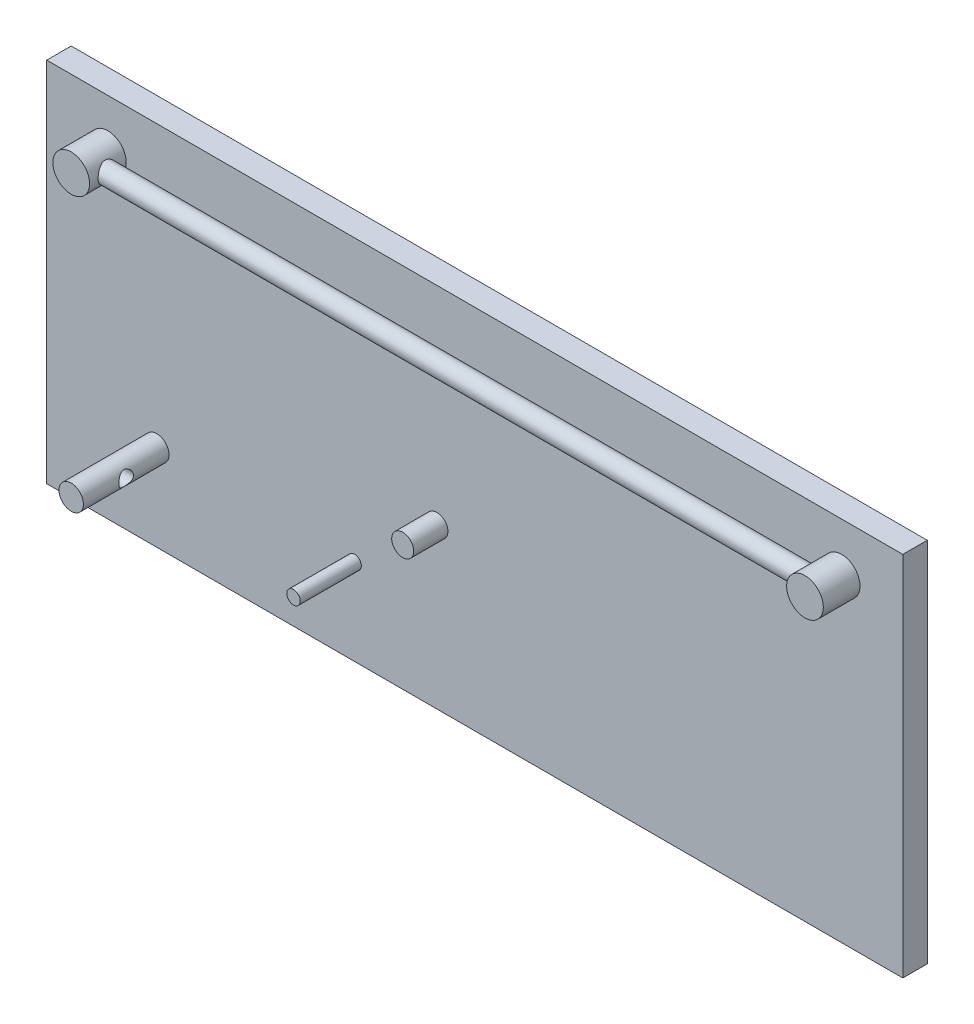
ISO-10303-21;
HEADER;
FILE_DESCRIPTION(('STEP AP214'),'2;1');
FILE_NAME('part.step','',(''),(''),'','','');
FILE_SCHEMA(('AUTOMOTIVE_DESIGN { 1 0 10303 214 1 1 1 1 }'));
ENDSEC;
DATA;
#1=APPLICATION_CONTEXT('core data for automotive mechanical design processes');
#2=APPLICATION_PROTOCOL_DEFINITION('international standard','automotive_design',2000,#1);
#3=PRODUCT_CONTEXT('',#1,'mechanical');
#4=PRODUCT('Part','Part','',(#3));
#5=PRODUCT_RELATED_PRODUCT_CATEGORY('part','',(#4));
#6=PRODUCT_DEFINITION_FORMATION('','',#4);
#7=PRODUCT_DEFINITION_CONTEXT('part definition',#1,'design');
#8=PRODUCT_DEFINITION('design','',#6,#7);
#9=PRODUCT_DEFINITION_SHAPE('','',#8);
#10=(LENGTH_UNIT() NAMED_UNIT(*) SI_UNIT(.MILLI.,.METRE.));
#11=(NAMED_UNIT(*) PLANE_ANGLE_UNIT() SI_UNIT($,.RADIAN.));
#12=(NAMED_UNIT(*) SI_UNIT($,.STERADIAN.) SOLID_ANGLE_UNIT());
#13=UNCERTAINTY_MEASURE_WITH_UNIT(LENGTH_MEASURE(1.E-05),#10,'distance_accuracy_value','');
#14=(GEOMETRIC_REPRESENTATION_CONTEXT(3) GLOBAL_UNCERTAINTY_ASSIGNED_CONTEXT((#13)) GLOBAL_UNIT_ASSIGNED_CONTEXT((#10,
#11,#12)) REPRESENTATION_CONTEXT('',''));
#15=CARTESIAN_POINT('',(0.,0.,0.));
#16=DIRECTION('',(0.,0.,1.));
#17=DIRECTION('',(1.,0.,0.));
#18=AXIS2_PLACEMENT_3D('',#15,#16,#17);
#19=CARTESIAN_POINT('',(-175.,-75.,10.));
#20=DIRECTION('',(0.,0.,1.));
#21=DIRECTION('',(1.,0.,0.));
#22=AXIS2_PLACEMENT_3D('',#19,#20,#21);
#23=PLANE('',#22);
#24=CARTESIAN_POINT('',(-130.,-39.7623712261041,10.));
#25=DIRECTION('',(0.,0.,1.));
#26=DIRECTION('',(1.,0.,0.));
#27=AXIS2_PLACEMENT_3D('',#24,#25,#26);
#28=CIRCLE('',#27,4.99999999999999);
#29=CARTESIAN_POINT('',(-125.,-39.7623712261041,10.));
#30=VERTEX_POINT('',#29);
#31=EDGE_CURVE('E192',#30,#30,#28,.T.);
#32=ORIENTED_EDGE('',*,*,#31,.F.);
#33=EDGE_LOOP('',(#32));
#34=FACE_BOUND('',#33,.T.);
#35=CARTESIAN_POINT('',(-150.,55.,10.));
#36=DIRECTION('',(0.,0.,1.));
#37=DIRECTION('',(-1.,0.,0.));
#38=AXIS2_PLACEMENT_3D('',#35,#36,#37);
#39=CIRCLE('',#38,7.50000000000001);
#40=CARTESIAN_POINT('',(-157.5,55.,10.));
#41=VERTEX_POINT('',#40);
#42=EDGE_CURVE('E175',#41,#41,#39,.T.);
#43=ORIENTED_EDGE('',*,*,#42,.F.);
#44=EDGE_LOOP('',(#43));
#45=FACE_BOUND('',#44,.T.);
#46=DIRECTION('',(0.,-1.,0.));
#47=VECTOR('',#46,1.);
#48=CARTESIAN_POINT('',(-175.,75.,10.));
#49=LINE('',#48,#47);
#50=CARTESIAN_POINT('',(-175.,75.,10.));
#51=VERTEX_POINT('',#50);
#52=CARTESIAN_POINT('',(-175.,-75.,10.));
#53=VERTEX_POINT('',#52);
#54=EDGE_CURVE('E109',#51,#53,#49,.T.);
#55=ORIENTED_EDGE('',*,*,#54,.T.);
#56=DIRECTION('',(1.,0.,0.));
#57=VECTOR('',#56,1.);
#58=CARTESIAN_POINT('',(-175.,-75.,10.));
#59=LINE('',#58,#57);
#60=CARTESIAN_POINT('',(175.,-75.,10.));
#61=VERTEX_POINT('',#60);
#62=EDGE_CURVE('E92',#53,#61,#59,.T.);
#63=ORIENTED_EDGE('',*,*,#62,.T.);
#64=DIRECTION('',(0.,1.,0.));
#65=VECTOR('',#64,1.);
#66=CARTESIAN_POINT('',(175.,75.,10.));
#67=LINE('',#66,#65);
#68=CARTESIAN_POINT('',(175.,75.,10.));
#69=VERTEX_POINT('',#68);
#70=EDGE_CURVE('E57',#61,#69,#67,.T.);
#71=ORIENTED_EDGE('',*,*,#70,.T.);
#72=DIRECTION('',(-1.,0.,0.));
#73=VECTOR('',#72,1.);
#74=CARTESIAN_POINT('',(-175.,75.,10.));
#75=LINE('',#74,#73);
#76=EDGE_CURVE('E52',#69,#51,#75,.T.);
#77=ORIENTED_EDGE('',*,*,#76,.T.);
#78=EDGE_LOOP('',(#55,#63,#71,#77));
#79=FACE_BOUND('',#78,.T.);
#80=CARTESIAN_POINT('',(150.,55.,10.));
#81=DIRECTION('',(0.,0.,1.));
#82=DIRECTION('',(1.,0.,0.));
#83=AXIS2_PLACEMENT_3D('',#80,#81,#82);
#84=CIRCLE('',#83,7.50000000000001);
#85=CARTESIAN_POINT('',(157.5,55.,10.));
#86=VERTEX_POINT('',#85);
#87=EDGE_CURVE('E102',#86,#86,#84,.T.);
#88=ORIENTED_EDGE('',*,*,#87,.F.);
#89=EDGE_LOOP('',(#88));
#90=FACE_BOUND('',#89,.T.);
#91=CARTESIAN_POINT('',(-15.4740295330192,-9.87837253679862,10.));
#92=DIRECTION('',(0.,0.,1.));
#93=DIRECTION('',(1.,0.,0.));
#94=AXIS2_PLACEMENT_3D('',#91,#92,#93);
#95=CIRCLE('',#94,4.5);
#96=CARTESIAN_POINT('',(-10.9740295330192,-9.87837253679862,10.));
#97=VERTEX_POINT('',#96);
#98=EDGE_CURVE('E186',#97,#97,#95,.T.);
#99=ORIENTED_EDGE('',*,*,#98,.F.);
#100=EDGE_LOOP('',(#99));
#101=FACE_BOUND('',#100,.T.);
#102=CARTESIAN_POINT('',(-49.1184439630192,-39.762371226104,10.));
#103=DIRECTION('',(0.,0.,1.));
#104=DIRECTION('',(1.,0.,0.));
#105=AXIS2_PLACEMENT_3D('',#102,#103,#104);
#106=CIRCLE('',#105,2.75);
#107=CARTESIAN_POINT('',(-46.3684439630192,-39.762371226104,10.));
#108=VERTEX_POINT('',#107);
#109=EDGE_CURVE('E226',#108,#108,#106,.T.);
#110=ORIENTED_EDGE('',*,*,#109,.F.);
#111=EDGE_LOOP('',(#110));
#112=FACE_BOUND('',#111,.T.);
#113=ADVANCED_FACE('F33',(#34,#45,#79,#90,#101,#112),#23,.T.);
#114=CARTESIAN_POINT('',(150.,55.,25.));
#115=DIRECTION('',(0.,0.,-1.));
#116=DIRECTION('',(-1.,0.,0.));
#117=AXIS2_PLACEMENT_3D('',#114,#115,#116);
#118=CYLINDRICAL_SURFACE('',#117,7.50000000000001);
#119=ORIENTED_EDGE('',*,*,#87,.T.);
#120=EDGE_LOOP('',(#119));
#121=FACE_BOUND('',#120,.T.);
#122=CARTESIAN_POINT('',(150.,55.,25.));
#123=DIRECTION('',(0.,0.,1.));
#124=DIRECTION('',(1.,0.,0.));
#125=AXIS2_PLACEMENT_3D('',#122,#123,#124);
#126=CIRCLE('',#125,7.50000000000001);
#127=CARTESIAN_POINT('',(157.5,55.,25.));
#128=VERTEX_POINT('',#127);
#129=EDGE_CURVE('E99',#128,#128,#126,.T.);
#130=ORIENTED_EDGE('',*,*,#129,.F.);
#131=EDGE_LOOP('',(#130));
#132=FACE_BOUND('',#131,.T.);
#133=CARTESIAN_POINT('',(142.5,55.,21.5));
#134=CARTESIAN_POINT('',(142.499999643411,55.1043292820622,21.5000004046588));
#135=CARTESIAN_POINT('',(142.502181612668,55.2086529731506,21.4959139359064));
#136=CARTESIAN_POINT('',(142.510852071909,55.4165195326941,21.4796211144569));
#137=CARTESIAN_POINT('',(142.517342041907,55.520062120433,21.4674119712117));
#138=CARTESIAN_POINT('',(142.534475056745,55.7256617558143,21.4350036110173));
#139=CARTESIAN_POINT('',(142.545122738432,55.827717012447,21.4147954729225));
#140=CARTESIAN_POINT('',(142.570297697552,56.0295097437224,21.3666381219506));
#141=CARTESIAN_POINT('',(142.584826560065,56.1292462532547,21.3386857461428));
#142=CARTESIAN_POINT('',(142.6335888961,56.4230748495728,21.2439272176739));
#143=CARTESIAN_POINT('',(142.673092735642,56.612856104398,21.1660473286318));
#144=CARTESIAN_POINT('',(142.762614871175,56.9762088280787,20.9836808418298));
#145=CARTESIAN_POINT('',(142.81263321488,57.149780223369,20.8791941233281));
#146=CARTESIAN_POINT('',(142.92260475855,57.4888283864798,20.6387413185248));
#147=CARTESIAN_POINT('',(142.98299608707,57.6530119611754,20.5011511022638));
#148=CARTESIAN_POINT('',(143.105646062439,57.957168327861,20.2019951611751));
#149=CARTESIAN_POINT('',(143.167906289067,58.0971199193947,20.0404086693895));
#150=CARTESIAN_POINT('',(143.29390118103,58.3617890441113,19.6800631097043));
#151=CARTESIAN_POINT('',(143.35725239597,58.4839528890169,19.4792578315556));
#152=CARTESIAN_POINT('',(143.442334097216,58.6401304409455,19.1623374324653));
#153=CARTESIAN_POINT('',(143.469044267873,58.6876894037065,19.0540404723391));
#154=CARTESIAN_POINT('',(143.518117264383,58.7732780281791,18.8328202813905));
#155=CARTESIAN_POINT('',(143.540482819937,58.8113136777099,18.719900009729));
#156=CARTESIAN_POINT('',(143.578670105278,58.875284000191,18.4973663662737));
#157=CARTESIAN_POINT('',(143.59481125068,58.9018220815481,18.3879811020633));
#158=CARTESIAN_POINT('',(143.621712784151,58.9456451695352,18.1667721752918));
#159=CARTESIAN_POINT('',(143.63247622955,58.9629354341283,18.0549499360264));
#160=CARTESIAN_POINT('',(143.648129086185,58.9879763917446,17.8299235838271));
#161=CARTESIAN_POINT('',(143.653023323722,58.9957349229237,17.7167206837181));
#162=CARTESIAN_POINT('',(143.656715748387,59.0015944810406,17.4899733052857));
#163=CARTESIAN_POINT('',(143.655514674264,58.9996966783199,17.376428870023));
#164=CARTESIAN_POINT('',(143.647674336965,58.9872297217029,17.1661195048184));
#165=CARTESIAN_POINT('',(143.641826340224,58.9779219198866,17.0692476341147));
#166=CARTESIAN_POINT('',(143.625896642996,58.9523442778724,16.8767703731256));
#167=CARTESIAN_POINT('',(143.615813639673,58.9360722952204,16.7811653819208));
#168=CARTESIAN_POINT('',(143.579685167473,58.8770796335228,16.4972327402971));
#169=CARTESIAN_POINT('',(143.547754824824,58.8241743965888,16.3116603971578));
#170=CARTESIAN_POINT('',(143.471185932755,58.6919483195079,15.9482808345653));
#171=CARTESIAN_POINT('',(143.42627800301,58.6120607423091,15.7707417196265));
#172=CARTESIAN_POINT('',(143.328747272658,58.4285815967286,15.4306591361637));
#173=CARTESIAN_POINT('',(143.276121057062,58.3249795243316,15.2681223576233));
#174=CARTESIAN_POINT('',(143.159775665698,58.0793506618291,14.9375729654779));
#175=CARTESIAN_POINT('',(143.095562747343,57.9339146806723,14.7722649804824));
#176=CARTESIAN_POINT('',(142.969414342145,57.6172236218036,14.4671045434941));
#177=CARTESIAN_POINT('',(142.907480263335,57.445952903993,14.3272676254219));
#178=CARTESIAN_POINT('',(142.819089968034,57.1667674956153,14.1356406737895));
#179=CARTESIAN_POINT('',(142.789630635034,57.0668672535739,14.0733399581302));
#180=CARTESIAN_POINT('',(142.733854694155,56.8613031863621,13.9574795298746));
#181=CARTESIAN_POINT('',(142.707536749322,56.7556418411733,13.9039160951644));
#182=CARTESIAN_POINT('',(142.65882020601,56.539277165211,13.8061244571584));
#183=CARTESIAN_POINT('',(142.636419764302,56.4285762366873,13.7618918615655));
#184=CARTESIAN_POINT('',(142.596209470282,56.2029177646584,13.6832925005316));
#185=CARTESIAN_POINT('',(142.578399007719,56.0879607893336,13.6489244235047));
#186=CARTESIAN_POINT('',(142.54931026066,55.8652619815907,13.5931739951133));
#187=CARTESIAN_POINT('',(142.537588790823,55.7578001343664,13.5709022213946));
#188=CARTESIAN_POINT('',(142.518748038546,55.5410189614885,13.5352350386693));
#189=CARTESIAN_POINT('',(142.511628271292,55.4316998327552,13.5218386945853));
#190=CARTESIAN_POINT('',(142.502197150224,55.2121724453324,13.5041141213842));
#191=CARTESIAN_POINT('',(142.499883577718,55.1019646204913,13.499781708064));
#192=CARTESIAN_POINT('',(142.50012545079,54.8815777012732,13.500235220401));
#193=CARTESIAN_POINT('',(142.502680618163,54.7713986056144,13.5050206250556));
#194=CARTESIAN_POINT('',(142.512134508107,54.5620171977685,13.522792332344));
#195=CARTESIAN_POINT('',(142.518616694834,54.4627286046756,13.5349925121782));
#196=CARTESIAN_POINT('',(142.535381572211,54.2656455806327,13.5667185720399));
#197=CARTESIAN_POINT('',(142.545665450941,54.1678516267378,13.5862467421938));
#198=CARTESIAN_POINT('',(142.58188649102,53.8777614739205,13.6555220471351));
#199=CARTESIAN_POINT('',(142.613202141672,53.6885697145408,13.715976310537));
#200=CARTESIAN_POINT('',(142.688372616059,53.3187187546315,13.8648791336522));
#201=CARTESIAN_POINT('',(142.732520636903,53.138389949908,13.9539881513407));
#202=CARTESIAN_POINT('',(142.829327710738,52.7946975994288,14.1568737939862));
#203=CARTESIAN_POINT('',(142.881990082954,52.6313407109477,14.2706600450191));
#204=CARTESIAN_POINT('',(142.997618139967,52.3075483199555,14.5337278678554));
#205=CARTESIAN_POINT('',(143.061082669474,52.149321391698,14.6855121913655));
#206=CARTESIAN_POINT('',(143.187363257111,51.8594549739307,15.0130503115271));
#207=CARTESIAN_POINT('',(143.250178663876,51.7278401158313,15.1888260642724));
#208=CARTESIAN_POINT('',(143.37252945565,51.4862815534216,15.5741875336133));
#209=CARTESIAN_POINT('',(143.431559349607,51.3783932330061,15.7852527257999));
#210=CARTESIAN_POINT('',(143.507378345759,51.2452071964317,16.1159144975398));
#211=CARTESIAN_POINT('',(143.530529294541,51.2055878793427,16.2284714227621));
#212=CARTESIAN_POINT('',(143.571628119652,51.136366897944,16.4575831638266));
#213=CARTESIAN_POINT('',(143.589576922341,51.106763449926,16.5741372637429));
#214=CARTESIAN_POINT('',(143.617933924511,51.0604701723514,16.7986232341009));
#215=CARTESIAN_POINT('',(143.628908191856,51.0428000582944,16.906282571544));
#216=CARTESIAN_POINT('',(143.645443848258,51.0163004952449,17.1230908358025));
#217=CARTESIAN_POINT('',(143.651005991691,51.0074698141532,17.2322395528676));
#218=CARTESIAN_POINT('',(143.656462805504,50.9988044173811,17.4509823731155));
#219=CARTESIAN_POINT('',(143.656360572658,50.9989647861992,17.5605762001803));
#220=CARTESIAN_POINT('',(143.650513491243,51.0082538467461,17.7791972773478));
#221=CARTESIAN_POINT('',(143.644769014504,51.0173819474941,17.8882245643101));
#222=CARTESIAN_POINT('',(143.62146710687,51.0547258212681,18.1865949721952));
#223=CARTESIAN_POINT('',(143.598265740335,51.0921489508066,18.3744376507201));
#224=CARTESIAN_POINT('',(143.53807089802,51.1925309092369,18.7407066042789));
#225=CARTESIAN_POINT('',(143.501072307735,51.2554992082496,18.9191293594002));
#226=CARTESIAN_POINT('',(143.414615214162,51.4095982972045,19.274512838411));
#227=CARTESIAN_POINT('',(143.36450757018,51.5022820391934,19.450638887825));
#228=CARTESIAN_POINT('',(143.258301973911,51.7116457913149,19.7860136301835));
#229=CARTESIAN_POINT('',(143.202200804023,51.8283387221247,19.9452531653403));
#230=CARTESIAN_POINT('',(143.080638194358,52.1020731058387,20.2663600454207));
#231=CARTESIAN_POINT('',(143.01499663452,52.2625093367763,20.4252756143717));
#232=CARTESIAN_POINT('',(142.88885125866,52.6092847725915,20.7148794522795));
#233=CARTESIAN_POINT('',(142.82835078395,52.7956406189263,20.8455494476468));
#234=CARTESIAN_POINT('',(142.74549083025,53.093912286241,21.018596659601));
#235=CARTESIAN_POINT('',(142.71891000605,53.1978594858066,21.0729731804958));
#236=CARTESIAN_POINT('',(142.669481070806,53.4108450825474,21.1726541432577));
#237=CARTESIAN_POINT('',(142.646631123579,53.5198809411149,21.2179630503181));
#238=CARTESIAN_POINT('',(142.605386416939,53.7420516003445,21.298883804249));
#239=CARTESIAN_POINT('',(142.586982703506,53.8551776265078,21.3345151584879));
#240=CARTESIAN_POINT('',(142.55515354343,54.0847532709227,21.3956928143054));
#241=CARTESIAN_POINT('',(142.541725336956,54.2012010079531,21.4212447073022));
#242=CARTESIAN_POINT('',(142.520773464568,54.4309218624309,21.4609467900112));
#243=CARTESIAN_POINT('',(142.513004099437,54.5440905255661,21.4755722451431));
#244=CARTESIAN_POINT('',(142.502617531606,54.7715083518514,21.4950986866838));
#245=CARTESIAN_POINT('',(142.500000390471,54.8857575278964,21.4999995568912));
#246=CARTESIAN_POINT('',(142.5,55.,21.5));
#247=B_SPLINE_CURVE_WITH_KNOTS('',3,(#133,#134,#135,#136,#137,#138,#139,#140,#141,#142,#143,
#144,#145,#146,#147,#148,#149,#150,#151,#152,#153,#154,#155,#156,#157,#158,#159,#160,#161,#162,
#163,#164,#165,#166,#167,#168,#169,#170,#171,#172,#173,#174,#175,#176,#177,#178,#179,#180,#181,
#182,#183,#184,#185,#186,#187,#188,#189,#190,#191,#192,#193,#194,#195,#196,#197,#198,#199,#200,
#201,#202,#203,#204,#205,#206,#207,#208,#209,#210,#211,#212,#213,#214,#215,#216,#217,#218,#219,
#220,#221,#222,#223,#224,#225,#226,#227,#228,#229,#230,#231,#232,#233,#234,#235,#236,#237,#238,
#239,#240,#241,#242,#243,#244,#245,#246),.UNSPECIFIED.,.T.,.F.,(4,2,2,2,2,2,2,2,2,2,2,2,2,2,2,2,
2,2,2,2,2,2,2,2,2,2,2,2,2,2,2,2,2,2,2,2,2,2,2,2,2,2,2,2,2,2,2,2,2,2,2,2,2,2,2,2,4),(0.,
0.312875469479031,0.625858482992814,0.939191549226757,1.25265277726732,1.87635275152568,
2.50005555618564,3.16498046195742,3.83048419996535,4.55668682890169,4.92002643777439,
5.28313701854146,5.6237663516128,5.96420180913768,6.30435713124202,6.64447122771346,
6.93659372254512,7.22880615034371,7.81285364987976,8.41002203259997,9.0074554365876,
9.69267368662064,10.3783084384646,10.7419894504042,11.1055151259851,11.4688692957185,
11.832175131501,12.1628321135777,12.4934542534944,12.8239237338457,13.1543743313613,
13.4547461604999,13.7552119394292,14.3555858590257,14.9709302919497,15.5865151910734,
16.2683843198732,16.9508817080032,17.6793249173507,18.0434998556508,18.407609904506,
18.736085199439,19.0645147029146,19.3927646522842,19.720992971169,20.2969971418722,
20.8732150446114,21.4865540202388,22.1002239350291,22.8026614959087,23.5055521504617,
23.8659835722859,24.2262370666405,24.5857589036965,24.9450810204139,25.2876812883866,
25.6302856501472),.UNSPECIFIED.);
#248=CARTESIAN_POINT('',(142.5,55.,21.5));
#249=VERTEX_POINT('',#248);
#250=EDGE_CURVE('E11',#249,#249,#247,.T.);
#251=ORIENTED_EDGE('',*,*,#250,.F.);
#252=EDGE_LOOP('',(#251));
#253=FACE_BOUND('',#252,.T.);
#254=ADVANCED_FACE('F144',(#121,#132,#253),#118,.T.);
#255=CARTESIAN_POINT('',(-150.,55.,25.));
#256=DIRECTION('',(0.,0.,-1.));
#257=DIRECTION('',(-1.,0.,0.));
#258=AXIS2_PLACEMENT_3D('',#255,#256,#257);
#259=CYLINDRICAL_SURFACE('',#258,7.50000000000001);
#260=ORIENTED_EDGE('',*,*,#42,.T.);
#261=EDGE_LOOP('',(#260));
#262=FACE_BOUND('',#261,.T.);
#263=CARTESIAN_POINT('',(-150.,55.,25.));
#264=DIRECTION('',(0.,0.,1.));
#265=DIRECTION('',(-1.,0.,0.));
#266=AXIS2_PLACEMENT_3D('',#263,#264,#265);
#267=CIRCLE('',#266,7.50000000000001);
#268=CARTESIAN_POINT('',(-157.5,55.,25.));
#269=VERTEX_POINT('',#268);
#270=EDGE_CURVE('E178',#269,#269,#267,.T.);
#271=ORIENTED_EDGE('',*,*,#270,.F.);
#272=EDGE_LOOP('',(#271));
#273=FACE_BOUND('',#272,.T.);
#274=CARTESIAN_POINT('',(-142.5,55.,21.5));
#275=CARTESIAN_POINT('',(-142.499999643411,54.8956707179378,21.5000004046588));
#276=CARTESIAN_POINT('',(-142.502181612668,54.7913470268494,21.4959139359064));
#277=CARTESIAN_POINT('',(-142.510852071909,54.5834804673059,21.4796211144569));
#278=CARTESIAN_POINT('',(-142.517342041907,54.479937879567,21.4674119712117));
#279=CARTESIAN_POINT('',(-142.534475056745,54.2743382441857,21.4350036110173));
#280=CARTESIAN_POINT('',(-142.545122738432,54.172282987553,21.4147954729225));
#281=CARTESIAN_POINT('',(-142.570297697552,53.9704902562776,21.3666381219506));
#282=CARTESIAN_POINT('',(-142.584826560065,53.8707537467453,21.3386857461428));
#283=CARTESIAN_POINT('',(-142.6335888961,53.5769251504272,21.2439272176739));
#284=CARTESIAN_POINT('',(-142.673092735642,53.387143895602,21.1660473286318));
#285=CARTESIAN_POINT('',(-142.762614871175,53.0237911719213,20.9836808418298));
#286=CARTESIAN_POINT('',(-142.81263321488,52.850219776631,20.8791941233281));
#287=CARTESIAN_POINT('',(-142.92260475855,52.5111716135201,20.6387413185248));
#288=CARTESIAN_POINT('',(-142.98299608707,52.3469880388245,20.5011511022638));
#289=CARTESIAN_POINT('',(-143.105646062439,52.042831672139,20.2019951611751));
#290=CARTESIAN_POINT('',(-143.167906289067,51.9028800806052,20.0404086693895));
#291=CARTESIAN_POINT('',(-143.29390118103,51.6382109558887,19.6800631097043));
#292=CARTESIAN_POINT('',(-143.35725239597,51.5160471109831,19.4792578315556));
#293=CARTESIAN_POINT('',(-143.442334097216,51.3598695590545,19.1623374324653));
#294=CARTESIAN_POINT('',(-143.469044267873,51.3123105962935,19.0540404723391));
#295=CARTESIAN_POINT('',(-143.518117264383,51.2267219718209,18.8328202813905));
#296=CARTESIAN_POINT('',(-143.540482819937,51.1886863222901,18.719900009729));
#297=CARTESIAN_POINT('',(-143.578670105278,51.124715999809,18.4973663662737));
#298=CARTESIAN_POINT('',(-143.59481125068,51.0981779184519,18.3879811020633));
#299=CARTESIAN_POINT('',(-143.621712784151,51.0543548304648,18.1667721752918));
#300=CARTESIAN_POINT('',(-143.63247622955,51.0370645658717,18.0549499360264));
#301=CARTESIAN_POINT('',(-143.648129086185,51.0120236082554,17.8299235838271));
#302=CARTESIAN_POINT('',(-143.653023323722,51.0042650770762,17.7167206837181));
#303=CARTESIAN_POINT('',(-143.656715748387,50.9984055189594,17.4899733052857));
#304=CARTESIAN_POINT('',(-143.655514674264,51.00030332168,17.376428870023));
#305=CARTESIAN_POINT('',(-143.647674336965,51.0127702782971,17.1661195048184));
#306=CARTESIAN_POINT('',(-143.641826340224,51.0220780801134,17.0692476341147));
#307=CARTESIAN_POINT('',(-143.625896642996,51.0476557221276,16.8767703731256));
#308=CARTESIAN_POINT('',(-143.615813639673,51.0639277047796,16.7811653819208));
#309=CARTESIAN_POINT('',(-143.579685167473,51.1229203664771,16.4972327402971));
#310=CARTESIAN_POINT('',(-143.547754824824,51.1758256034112,16.3116603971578));
#311=CARTESIAN_POINT('',(-143.471185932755,51.3080516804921,15.9482808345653));
#312=CARTESIAN_POINT('',(-143.42627800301,51.3879392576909,15.7707417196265));
#313=CARTESIAN_POINT('',(-143.328747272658,51.5714184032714,15.4306591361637));
#314=CARTESIAN_POINT('',(-143.276121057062,51.6750204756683,15.2681223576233));
#315=CARTESIAN_POINT('',(-143.159775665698,51.9206493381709,14.9375729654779));
#316=CARTESIAN_POINT('',(-143.095562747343,52.0660853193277,14.7722649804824));
#317=CARTESIAN_POINT('',(-142.969414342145,52.3827763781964,14.4671045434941));
#318=CARTESIAN_POINT('',(-142.907480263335,52.554047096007,14.3272676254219));
#319=CARTESIAN_POINT('',(-142.819089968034,52.8332325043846,14.1356406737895));
#320=CARTESIAN_POINT('',(-142.789630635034,52.9331327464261,14.0733399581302));
#321=CARTESIAN_POINT('',(-142.733854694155,53.1386968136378,13.9574795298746));
#322=CARTESIAN_POINT('',(-142.707536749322,53.2443581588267,13.9039160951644));
#323=CARTESIAN_POINT('',(-142.65882020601,53.460722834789,13.8061244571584));
#324=CARTESIAN_POINT('',(-142.636419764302,53.5714237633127,13.7618918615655));
#325=CARTESIAN_POINT('',(-142.596209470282,53.7970822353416,13.6832925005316));
#326=CARTESIAN_POINT('',(-142.578399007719,53.9120392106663,13.6489244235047));
#327=CARTESIAN_POINT('',(-142.54931026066,54.1347380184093,13.5931739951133));
#328=CARTESIAN_POINT('',(-142.537588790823,54.2421998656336,13.5709022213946));
#329=CARTESIAN_POINT('',(-142.518748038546,54.4589810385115,13.5352350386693));
#330=CARTESIAN_POINT('',(-142.511628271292,54.5683001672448,13.5218386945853));
#331=CARTESIAN_POINT('',(-142.502197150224,54.7878275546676,13.5041141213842));
#332=CARTESIAN_POINT('',(-142.499883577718,54.8980353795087,13.499781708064));
#333=CARTESIAN_POINT('',(-142.50012545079,55.1184222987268,13.500235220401));
#334=CARTESIAN_POINT('',(-142.502680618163,55.2286013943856,13.5050206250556));
#335=CARTESIAN_POINT('',(-142.512134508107,55.4379828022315,13.522792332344));
#336=CARTESIAN_POINT('',(-142.518616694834,55.5372713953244,13.5349925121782));
#337=CARTESIAN_POINT('',(-142.535381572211,55.7343544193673,13.5667185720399));
#338=CARTESIAN_POINT('',(-142.545665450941,55.8321483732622,13.5862467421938));
#339=CARTESIAN_POINT('',(-142.58188649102,56.1222385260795,13.6555220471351));
#340=CARTESIAN_POINT('',(-142.613202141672,56.3114302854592,13.715976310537));
#341=CARTESIAN_POINT('',(-142.688372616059,56.6812812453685,13.8648791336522));
#342=CARTESIAN_POINT('',(-142.732520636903,56.8616100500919,13.9539881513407));
#343=CARTESIAN_POINT('',(-142.829327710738,57.2053024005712,14.1568737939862));
#344=CARTESIAN_POINT('',(-142.881990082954,57.3686592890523,14.2706600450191));
#345=CARTESIAN_POINT('',(-142.997618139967,57.6924516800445,14.5337278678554));
#346=CARTESIAN_POINT('',(-143.061082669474,57.850678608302,14.6855121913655));
#347=CARTESIAN_POINT('',(-143.187363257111,58.1405450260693,15.0130503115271));
#348=CARTESIAN_POINT('',(-143.250178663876,58.2721598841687,15.1888260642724));
#349=CARTESIAN_POINT('',(-143.37252945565,58.5137184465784,15.5741875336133));
#350=CARTESIAN_POINT('',(-143.431559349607,58.6216067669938,15.7852527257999));
#351=CARTESIAN_POINT('',(-143.507378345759,58.7547928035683,16.1159144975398));
#352=CARTESIAN_POINT('',(-143.530529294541,58.7944121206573,16.2284714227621));
#353=CARTESIAN_POINT('',(-143.571628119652,58.863633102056,16.4575831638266));
#354=CARTESIAN_POINT('',(-143.589576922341,58.893236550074,16.5741372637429));
#355=CARTESIAN_POINT('',(-143.617933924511,58.9395298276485,16.7986232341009));
#356=CARTESIAN_POINT('',(-143.628908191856,58.9571999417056,16.906282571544));
#357=CARTESIAN_POINT('',(-143.645443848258,58.9836995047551,17.1230908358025));
#358=CARTESIAN_POINT('',(-143.651005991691,58.9925301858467,17.2322395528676));
#359=CARTESIAN_POINT('',(-143.656462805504,59.0011955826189,17.4509823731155));
#360=CARTESIAN_POINT('',(-143.656360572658,59.0010352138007,17.5605762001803));
#361=CARTESIAN_POINT('',(-143.650513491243,58.9917461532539,17.7791972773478));
#362=CARTESIAN_POINT('',(-143.644769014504,58.9826180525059,17.8882245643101));
#363=CARTESIAN_POINT('',(-143.62146710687,58.9452741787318,18.1865949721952));
#364=CARTESIAN_POINT('',(-143.598265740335,58.9078510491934,18.3744376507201));
#365=CARTESIAN_POINT('',(-143.53807089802,58.8074690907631,18.7407066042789));
#366=CARTESIAN_POINT('',(-143.501072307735,58.7445007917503,18.9191293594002));
#367=CARTESIAN_POINT('',(-143.414615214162,58.5904017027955,19.274512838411));
#368=CARTESIAN_POINT('',(-143.36450757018,58.4977179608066,19.450638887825));
#369=CARTESIAN_POINT('',(-143.258301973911,58.288354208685,19.7860136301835));
#370=CARTESIAN_POINT('',(-143.202200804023,58.1716612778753,19.9452531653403));
#371=CARTESIAN_POINT('',(-143.080638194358,57.8979268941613,20.2663600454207));
#372=CARTESIAN_POINT('',(-143.01499663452,57.7374906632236,20.4252756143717));
#373=CARTESIAN_POINT('',(-142.88885125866,57.3907152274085,20.7148794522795));
#374=CARTESIAN_POINT('',(-142.82835078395,57.2043593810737,20.8455494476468));
#375=CARTESIAN_POINT('',(-142.74549083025,56.906087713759,21.018596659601));
#376=CARTESIAN_POINT('',(-142.71891000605,56.8021405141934,21.0729731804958));
#377=CARTESIAN_POINT('',(-142.669481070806,56.5891549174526,21.1726541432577));
#378=CARTESIAN_POINT('',(-142.646631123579,56.4801190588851,21.2179630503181));
#379=CARTESIAN_POINT('',(-142.605386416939,56.2579483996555,21.298883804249));
#380=CARTESIAN_POINT('',(-142.586982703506,56.1448223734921,21.3345151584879));
#381=CARTESIAN_POINT('',(-142.55515354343,55.9152467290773,21.3956928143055));
#382=CARTESIAN_POINT('',(-142.541725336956,55.7987989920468,21.4212447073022));
#383=CARTESIAN_POINT('',(-142.520773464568,55.5690781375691,21.4609467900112));
#384=CARTESIAN_POINT('',(-142.513004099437,55.4559094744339,21.4755722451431));
#385=CARTESIAN_POINT('',(-142.502617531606,55.2284916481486,21.4950986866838));
#386=CARTESIAN_POINT('',(-142.500000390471,55.1142424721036,21.4999995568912));
#387=CARTESIAN_POINT('',(-142.5,55.,21.5));
#388=B_SPLINE_CURVE_WITH_KNOTS('',3,(#274,#275,#276,#277,#278,#279,#280,#281,#282,#283,#284,
#285,#286,#287,#288,#289,#290,#291,#292,#293,#294,#295,#296,#297,#298,#299,#300,#301,#302,#303,
#304,#305,#306,#307,#308,#309,#310,#311,#312,#313,#314,#315,#316,#317,#318,#319,#320,#321,#322,
#323,#324,#325,#326,#327,#328,#329,#330,#331,#332,#333,#334,#335,#336,#337,#338,#339,#340,#341,
#342,#343,#344,#345,#346,#347,#348,#349,#350,#351,#352,#353,#354,#355,#356,#357,#358,#359,#360,
#361,#362,#363,#364,#365,#366,#367,#368,#369,#370,#371,#372,#373,#374,#375,#376,#377,#378,#379,
#380,#381,#382,#383,#384,#385,#386,#387),.UNSPECIFIED.,.T.,.F.,(4,2,2,2,2,2,2,2,2,2,2,2,2,2,2,2,
2,2,2,2,2,2,2,2,2,2,2,2,2,2,2,2,2,2,2,2,2,2,2,2,2,2,2,2,2,2,2,2,2,2,2,2,2,2,2,2,4),(0.,
0.312875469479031,0.625858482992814,0.939191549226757,1.25265277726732,1.87635275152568,
2.50005555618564,3.16498046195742,3.83048419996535,4.55668682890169,4.92002643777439,
5.28313701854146,5.6237663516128,5.96420180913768,6.30435713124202,6.64447122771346,
6.93659372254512,7.22880615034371,7.81285364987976,8.41002203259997,9.0074554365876,
9.69267368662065,10.3783084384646,10.7419894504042,11.1055151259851,11.4688692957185,
11.832175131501,12.1628321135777,12.4934542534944,12.8239237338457,13.1543743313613,
13.4547461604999,13.7552119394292,14.3555858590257,14.9709302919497,15.5865151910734,
16.2683843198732,16.9508817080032,17.6793249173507,18.0434998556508,18.407609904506,
18.736085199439,19.0645147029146,19.3927646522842,19.720992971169,20.2969971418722,
20.8732150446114,21.4865540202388,22.1002239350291,22.8026614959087,23.5055521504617,
23.8659835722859,24.2262370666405,24.5857589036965,24.9450810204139,25.2876812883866,
25.6302856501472),.UNSPECIFIED.);
#389=CARTESIAN_POINT('',(-142.5,55.,21.5));
#390=VERTEX_POINT('',#389);
#391=EDGE_CURVE('E45',#390,#390,#388,.T.);
#392=ORIENTED_EDGE('',*,*,#391,.F.);
#393=EDGE_LOOP('',(#392));
#394=FACE_BOUND('',#393,.T.);
#395=ADVANCED_FACE('F122',(#262,#273,#394),#259,.T.);
#396=CARTESIAN_POINT('',(-175.,75.,10.));
#397=DIRECTION('',(1.,0.,0.));
#398=DIRECTION('',(0.,0.,-1.));
#399=AXIS2_PLACEMENT_3D('',#396,#397,#398);
#400=PLANE('',#399);
#401=DIRECTION('',(0.,-1.,0.));
#402=VECTOR('',#401,1.);
#403=CARTESIAN_POINT('',(-175.,75.,0.));
#404=LINE('',#403,#402);
#405=CARTESIAN_POINT('',(-175.,75.,0.));
#406=VERTEX_POINT('',#405);
#407=CARTESIAN_POINT('',(-175.,-75.,0.));
#408=VERTEX_POINT('',#407);
#409=EDGE_CURVE('E83',#406,#408,#404,.T.);
#410=ORIENTED_EDGE('',*,*,#409,.T.);
#411=DIRECTION('',(0.,0.,-1.));
#412=VECTOR('',#411,1.);
#413=CARTESIAN_POINT('',(-175.,-75.,10.));
#414=LINE('',#413,#412);
#415=EDGE_CURVE('E90',#53,#408,#414,.T.);
#416=ORIENTED_EDGE('',*,*,#415,.F.);
#417=ORIENTED_EDGE('',*,*,#54,.F.);
#418=DIRECTION('',(0.,0.,-1.));
#419=VECTOR('',#418,1.);
#420=CARTESIAN_POINT('',(-175.,75.,10.));
#421=LINE('',#420,#419);
#422=EDGE_CURVE('E98',#51,#406,#421,.T.);
#423=ORIENTED_EDGE('',*,*,#422,.T.);
#424=EDGE_LOOP('',(#410,#416,#417,#423));
#425=FACE_BOUND('',#424,.T.);
#426=ADVANCED_FACE('F35',(#425),#400,.F.);
#427=CARTESIAN_POINT('',(-175.,-75.,10.));
#428=DIRECTION('',(0.,1.,0.));
#429=DIRECTION('',(0.,0.,1.));
#430=AXIS2_PLACEMENT_3D('',#427,#428,#429);
#431=PLANE('',#430);
#432=DIRECTION('',(1.,0.,0.));
#433=VECTOR('',#432,1.);
#434=CARTESIAN_POINT('',(-175.,-75.,0.));
#435=LINE('',#434,#433);
#436=CARTESIAN_POINT('',(175.,-75.,0.));
#437=VERTEX_POINT('',#436);
#438=EDGE_CURVE('E78',#408,#437,#435,.T.);
#439=ORIENTED_EDGE('',*,*,#438,.T.);
#440=DIRECTION('',(0.,0.,-1.));
#441=VECTOR('',#440,1.);
#442=CARTESIAN_POINT('',(175.,-75.,10.));
#443=LINE('',#442,#441);
#444=EDGE_CURVE('E95',#61,#437,#443,.T.);
#445=ORIENTED_EDGE('',*,*,#444,.F.);
#446=ORIENTED_EDGE('',*,*,#62,.F.);
#447=ORIENTED_EDGE('',*,*,#415,.T.);
#448=EDGE_LOOP('',(#439,#445,#446,#447));
#449=FACE_BOUND('',#448,.T.);
#450=ADVANCED_FACE('F91',(#449),#431,.F.);
#451=CARTESIAN_POINT('',(175.,75.,10.));
#452=DIRECTION('',(-1.,0.,0.));
#453=DIRECTION('',(0.,0.,1.));
#454=AXIS2_PLACEMENT_3D('',#451,#452,#453);
#455=PLANE('',#454);
#456=DIRECTION('',(0.,1.,0.));
#457=VECTOR('',#456,1.);
#458=CARTESIAN_POINT('',(175.,75.,0.));
#459=LINE('',#458,#457);
#460=CARTESIAN_POINT('',(175.,75.,0.));
#461=VERTEX_POINT('',#460);
#462=EDGE_CURVE('E84',#437,#461,#459,.T.);
#463=ORIENTED_EDGE('',*,*,#462,.T.);
#464=DIRECTION('',(0.,0.,-1.));
#465=VECTOR('',#464,1.);
#466=CARTESIAN_POINT('',(175.,75.,10.));
#467=LINE('',#466,#465);
#468=EDGE_CURVE('E115',#69,#461,#467,.T.);
#469=ORIENTED_EDGE('',*,*,#468,.F.);
#470=ORIENTED_EDGE('',*,*,#70,.F.);
#471=ORIENTED_EDGE('',*,*,#444,.T.);
#472=EDGE_LOOP('',(#463,#469,#470,#471));
#473=FACE_BOUND('',#472,.T.);
#474=ADVANCED_FACE('F158',(#473),#455,.F.);
#475=CARTESIAN_POINT('',(-175.,75.,10.));
#476=DIRECTION('',(0.,-1.,0.));
#477=DIRECTION('',(0.,0.,-1.));
#478=AXIS2_PLACEMENT_3D('',#475,#476,#477);
#479=PLANE('',#478);
#480=DIRECTION('',(-1.,0.,0.));
#481=VECTOR('',#480,1.);
#482=CARTESIAN_POINT('',(-175.,75.,0.));
#483=LINE('',#482,#481);
#484=EDGE_CURVE('E107',#461,#406,#483,.T.);
#485=ORIENTED_EDGE('',*,*,#484,.T.);
#486=ORIENTED_EDGE('',*,*,#422,.F.);
#487=ORIENTED_EDGE('',*,*,#76,.F.);
#488=ORIENTED_EDGE('',*,*,#468,.T.);
#489=EDGE_LOOP('',(#485,#486,#487,#488));
#490=FACE_BOUND('',#489,.T.);
#491=ADVANCED_FACE('F155',(#490),#479,.F.);
#492=CARTESIAN_POINT('',(-175.,-75.,0.));
#493=DIRECTION('',(0.,0.,1.));
#494=DIRECTION('',(1.,0.,0.));
#495=AXIS2_PLACEMENT_3D('',#492,#493,#494);
#496=PLANE('',#495);
#497=ORIENTED_EDGE('',*,*,#409,.F.);
#498=ORIENTED_EDGE('',*,*,#484,.F.);
#499=ORIENTED_EDGE('',*,*,#462,.F.);
#500=ORIENTED_EDGE('',*,*,#438,.F.);
#501=EDGE_LOOP('',(#497,#498,#499,#500));
#502=FACE_BOUND('',#501,.T.);
#503=ADVANCED_FACE('F80',(#502),#496,.F.);
#504=CARTESIAN_POINT('',(150.,55.,25.));
#505=DIRECTION('',(0.,0.,1.));
#506=DIRECTION('',(1.,0.,0.));
#507=AXIS2_PLACEMENT_3D('',#504,#505,#506);
#508=PLANE('',#507);
#509=ORIENTED_EDGE('',*,*,#129,.T.);
#510=EDGE_LOOP('',(#509));
#511=FACE_BOUND('',#510,.T.);
#512=ADVANCED_FACE('F136',(#511),#508,.T.);
#513=CARTESIAN_POINT('',(-150.,55.,25.));
#514=DIRECTION('',(0.,0.,-1.));
#515=DIRECTION('',(-1.,0.,0.));
#516=AXIS2_PLACEMENT_3D('',#513,#514,#515);
#517=PLANE('',#516);
#518=ORIENTED_EDGE('',*,*,#270,.T.);
#519=EDGE_LOOP('',(#518));
#520=FACE_BOUND('',#519,.T.);
#521=ADVANCED_FACE('F131',(#520),#517,.F.);
#522=CARTESIAN_POINT('',(175.001,55.,17.5));
#523=DIRECTION('',(-1.,0.,0.));
#524=DIRECTION('',(0.,0.,1.));
#525=AXIS2_PLACEMENT_3D('',#522,#523,#524);
#526=CYLINDRICAL_SURFACE('',#525,4.);
#527=ORIENTED_EDGE('',*,*,#250,.T.);
#528=EDGE_LOOP('',(#527));
#529=FACE_BOUND('',#528,.T.);
#530=ORIENTED_EDGE('',*,*,#391,.T.);
#531=EDGE_LOOP('',(#530));
#532=FACE_BOUND('',#531,.T.);
#533=ADVANCED_FACE('F126',(#529,#532),#526,.T.);
#534=CARTESIAN_POINT('',(-15.4740295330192,-9.87837253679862,24.));
#535=DIRECTION('',(0.,0.,-1.));
#536=DIRECTION('',(-1.,0.,0.));
#537=AXIS2_PLACEMENT_3D('',#534,#535,#536);
#538=CYLINDRICAL_SURFACE('',#537,4.5);
#539=CARTESIAN_POINT('',(-15.4740295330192,-9.87837253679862,24.));
#540=DIRECTION('',(0.,0.,1.));
#541=DIRECTION('',(1.,0.,0.));
#542=AXIS2_PLACEMENT_3D('',#539,#540,#541);
#543=CIRCLE('',#542,4.5);
#544=CARTESIAN_POINT('',(-10.9740295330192,-9.87837253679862,24.));
#545=VERTEX_POINT('',#544);
#546=EDGE_CURVE('E183',#545,#545,#543,.T.);
#547=ORIENTED_EDGE('',*,*,#546,.F.);
#548=EDGE_LOOP('',(#547));
#549=FACE_BOUND('',#548,.T.);
#550=ORIENTED_EDGE('',*,*,#98,.T.);
#551=EDGE_LOOP('',(#550));
#552=FACE_BOUND('',#551,.T.);
#553=ADVANCED_FACE('F130',(#549,#552),#538,.T.);
#554=CARTESIAN_POINT('',(-15.4740295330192,-9.87837253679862,24.));
#555=DIRECTION('',(0.,0.,1.));
#556=DIRECTION('',(1.,0.,0.));
#557=AXIS2_PLACEMENT_3D('',#554,#555,#556);
#558=PLANE('',#557);
#559=ORIENTED_EDGE('',*,*,#546,.T.);
#560=EDGE_LOOP('',(#559));
#561=FACE_BOUND('',#560,.T.);
#562=ADVANCED_FACE('F241',(#561),#558,.T.);
#563=CARTESIAN_POINT('',(-130.,-39.7623712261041,45.));
#564=DIRECTION('',(0.,0.,-1.));
#565=DIRECTION('',(-1.,0.,0.));
#566=AXIS2_PLACEMENT_3D('',#563,#564,#565);
#567=CYLINDRICAL_SURFACE('',#566,4.99999999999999);
#568=CARTESIAN_POINT('',(-135.,-39.7623712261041,30.5));
#569=CARTESIAN_POINT('',(-134.999999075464,-39.6856014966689,30.4999989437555));
#570=CARTESIAN_POINT('',(-134.998225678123,-39.6088090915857,30.4970464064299));
#571=CARTESIAN_POINT('',(-134.991183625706,-39.4558227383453,30.4852857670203));
#572=CARTESIAN_POINT('',(-134.98591292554,-39.3796291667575,30.4764742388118));
#573=CARTESIAN_POINT('',(-134.964993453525,-39.1525630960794,30.4413514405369));
#574=CARTESIAN_POINT('',(-134.944237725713,-39.0033893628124,30.4063522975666));
#575=CARTESIAN_POINT('',(-134.891232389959,-38.7148295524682,30.3152272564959));
#576=CARTESIAN_POINT('',(-134.859039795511,-38.5753989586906,30.2592060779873));
#577=CARTESIAN_POINT('',(-134.785907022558,-38.3083207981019,30.128279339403));
#578=CARTESIAN_POINT('',(-134.744969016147,-38.1806703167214,30.0533784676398));
#579=CARTESIAN_POINT('',(-134.654107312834,-37.9297696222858,29.8804503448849));
#580=CARTESIAN_POINT('',(-134.603735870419,-37.8076023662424,29.7810926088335));
#581=CARTESIAN_POINT('',(-134.500608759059,-37.5806066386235,29.5650655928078));
#582=CARTESIAN_POINT('',(-134.447850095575,-37.4758007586,29.4483741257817));
#583=CARTESIAN_POINT('',(-134.338221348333,-37.2734710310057,29.1841529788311));
#584=CARTESIAN_POINT('',(-134.281640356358,-37.1784158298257,29.0345964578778));
#585=CARTESIAN_POINT('',(-134.178766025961,-37.0151425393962,28.7183068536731));
#586=CARTESIAN_POINT('',(-134.132456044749,-36.9468808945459,28.5516022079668));
#587=CARTESIAN_POINT('',(-134.067092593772,-36.8535591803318,28.2468070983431));
#588=CARTESIAN_POINT('',(-134.044157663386,-36.8220472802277,28.1115280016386));
#589=CARTESIAN_POINT('',(-134.011806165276,-36.7780477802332,27.8363925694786));
#590=CARTESIAN_POINT('',(-134.002372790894,-36.7655365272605,27.696542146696));
#591=CARTESIAN_POINT('',(-133.998418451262,-36.7602610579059,27.4159770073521));
#592=CARTESIAN_POINT('',(-134.003926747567,-36.7675355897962,27.2752611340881));
#593=CARTESIAN_POINT('',(-134.029065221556,-36.801449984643,26.9974424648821));
#594=CARTESIAN_POINT('',(-134.048706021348,-36.8281044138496,26.8603424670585));
#595=CARTESIAN_POINT('',(-134.099063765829,-36.8988929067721,26.5949394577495));
#596=CARTESIAN_POINT('',(-134.129634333,-36.9427966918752,26.4665456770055));
#597=CARTESIAN_POINT('',(-134.19854092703,-37.0464695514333,26.2186102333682));
#598=CARTESIAN_POINT('',(-134.236879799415,-37.1062444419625,26.099071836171));
#599=CARTESIAN_POINT('',(-134.325106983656,-37.2520134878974,25.8500308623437));
#600=CARTESIAN_POINT('',(-134.375842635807,-37.3407645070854,25.7224400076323));
#601=CARTESIAN_POINT('',(-134.478610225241,-37.5365415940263,25.4826508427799));
#602=CARTESIAN_POINT('',(-134.530643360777,-37.643585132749,25.3704674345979));
#603=CARTESIAN_POINT('',(-134.638717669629,-37.8907808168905,25.1487577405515));
#604=CARTESIAN_POINT('',(-134.694306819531,-38.0334680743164,25.0417806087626));
#605=CARTESIAN_POINT('',(-134.77018325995,-38.2617606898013,24.9007312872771));
#606=CARTESIAN_POINT('',(-134.794233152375,-38.3402730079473,24.8569358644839));
#607=CARTESIAN_POINT('',(-134.839164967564,-38.5016275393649,24.776281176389));
#608=CARTESIAN_POINT('',(-134.86004883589,-38.5844670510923,24.7394176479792));
#609=CARTESIAN_POINT('',(-134.896826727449,-38.7486075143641,24.6751885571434));
#610=CARTESIAN_POINT('',(-134.91295100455,-38.8296811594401,24.6473734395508));
#611=CARTESIAN_POINT('',(-134.941391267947,-38.9944912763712,24.5986660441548));
#612=CARTESIAN_POINT('',(-134.953709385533,-39.0782262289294,24.5777698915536));
#613=CARTESIAN_POINT('',(-134.974163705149,-39.2476267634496,24.5432281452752));
#614=CARTESIAN_POINT('',(-134.982302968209,-39.3332908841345,24.5295772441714));
#615=CARTESIAN_POINT('',(-134.994159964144,-39.5057494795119,24.5097338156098));
#616=CARTESIAN_POINT('',(-134.997878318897,-39.5925437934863,24.5035402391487));
#617=CARTESIAN_POINT('',(-135.001791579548,-39.8296954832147,24.4970073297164));
#618=CARTESIAN_POINT('',(-134.997465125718,-39.9804280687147,24.5041884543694));
#619=CARTESIAN_POINT('',(-134.975579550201,-40.2780581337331,24.5408455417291));
#620=CARTESIAN_POINT('',(-134.958020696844,-40.424955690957,24.5703210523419));
#621=CARTESIAN_POINT('',(-134.911894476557,-40.7075138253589,24.6490884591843));
#622=CARTESIAN_POINT('',(-134.883605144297,-40.8433607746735,24.697881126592));
#623=CARTESIAN_POINT('',(-134.818277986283,-41.1049046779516,24.8133543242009));
#624=CARTESIAN_POINT('',(-134.781238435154,-41.2305996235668,24.8800383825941));
#625=CARTESIAN_POINT('',(-134.696909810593,-41.4823831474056,25.037114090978));
#626=CARTESIAN_POINT('',(-134.64895602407,-41.6071593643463,25.1292476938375));
#627=CARTESIAN_POINT('',(-134.549485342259,-41.8404234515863,25.3307827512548));
#628=CARTESIAN_POINT('',(-134.497964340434,-41.9488920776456,25.4402042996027));
#629=CARTESIAN_POINT('',(-134.388908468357,-42.1610111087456,25.6898207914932));
#630=CARTESIAN_POINT('',(-134.331464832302,-42.2621916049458,25.832167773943));
#631=CARTESIAN_POINT('',(-134.224323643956,-42.4392760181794,26.1344320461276));
#632=CARTESIAN_POINT('',(-134.174617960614,-42.5152065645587,26.2943305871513));
#633=CARTESIAN_POINT('',(-134.099698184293,-42.6252227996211,26.5924860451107));
#634=CARTESIAN_POINT('',(-134.071513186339,-42.6648037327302,26.7279606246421));
#635=CARTESIAN_POINT('',(-134.028192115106,-42.724644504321,27.0050641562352));
#636=CARTESIAN_POINT('',(-134.013037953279,-42.7449311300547,27.1466842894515));
#637=CARTESIAN_POINT('',(-133.998008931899,-42.7650538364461,27.4327538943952));
#638=CARTESIAN_POINT('',(-133.998191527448,-42.7648130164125,27.5772119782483));
#639=CARTESIAN_POINT('',(-134.013954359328,-42.7437006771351,27.8637888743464));
#640=CARTESIAN_POINT('',(-134.029542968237,-42.7228179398,28.0059063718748));
#641=CARTESIAN_POINT('',(-134.072663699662,-42.6631747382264,28.2769768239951));
#642=CARTESIAN_POINT('',(-134.099584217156,-42.6253240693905,28.4062341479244));
#643=CARTESIAN_POINT('',(-134.162110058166,-42.5336359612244,28.6566745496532));
#644=CARTESIAN_POINT('',(-134.197718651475,-42.4797925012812,28.777854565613));
#645=CARTESIAN_POINT('',(-134.280259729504,-42.348156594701,29.02863953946));
#646=CARTESIAN_POINT('',(-134.328091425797,-42.2679564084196,29.1566815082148));
#647=CARTESIAN_POINT('',(-134.426402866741,-42.0898833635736,29.3987608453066));
#648=CARTESIAN_POINT('',(-134.476884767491,-41.9919959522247,29.5127865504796));
#649=CARTESIAN_POINT('',(-134.584512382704,-41.7625747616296,29.7426988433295));
#650=CARTESIAN_POINT('',(-134.641400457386,-41.6281569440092,29.8558498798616));
#651=CARTESIAN_POINT('',(-134.74731429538,-41.3392640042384,30.0582079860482));
#652=CARTESIAN_POINT('',(-134.796337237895,-41.1847817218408,30.1474064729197));
#653=CARTESIAN_POINT('',(-134.859205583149,-40.9433931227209,30.2591244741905));
#654=CARTESIAN_POINT('',(-134.878171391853,-40.8626213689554,30.2923359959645));
#655=CARTESIAN_POINT('',(-134.912434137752,-40.6978134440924,30.3517721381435));
#656=CARTESIAN_POINT('',(-134.927733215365,-40.6137792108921,30.3780008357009));
#657=CARTESIAN_POINT('',(-134.95415527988,-40.4433730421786,30.4230094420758));
#658=CARTESIAN_POINT('',(-134.96529044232,-40.3570087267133,30.4418110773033));
#659=CARTESIAN_POINT('',(-134.983083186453,-40.1825549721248,30.471744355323));
#660=CARTESIAN_POINT('',(-134.989744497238,-40.0944670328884,30.4828823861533));
#661=CARTESIAN_POINT('',(-134.996037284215,-39.9654951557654,30.4933916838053));
#662=CARTESIAN_POINT('',(-134.997521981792,-39.9249275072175,30.495868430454));
#663=CARTESIAN_POINT('',(-134.999503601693,-39.8436991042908,30.4991728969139));
#664=CARTESIAN_POINT('',(-135.000000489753,-39.8030383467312,30.5000005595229));
#665=CARTESIAN_POINT('',(-135.,-39.7623712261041,30.5));
#666=B_SPLINE_CURVE_WITH_KNOTS('',3,(#568,#569,#570,#571,#572,#573,#574,#575,#576,#577,#578,
#579,#580,#581,#582,#583,#584,#585,#586,#587,#588,#589,#590,#591,#592,#593,#594,#595,#596,#597,
#598,#599,#600,#601,#602,#603,#604,#605,#606,#607,#608,#609,#610,#611,#612,#613,#614,#615,#616,
#617,#618,#619,#620,#621,#622,#623,#624,#625,#626,#627,#628,#629,#630,#631,#632,#633,#634,#635,
#636,#637,#638,#639,#640,#641,#642,#643,#644,#645,#646,#647,#648,#649,#650,#651,#652,#653,#654,
#655,#656,#657,#658,#659,#660,#661,#662,#663,#664,#665),.UNSPECIFIED.,.T.,.F.,(4,2,2,2,2,2,2,2,
2,2,2,2,2,2,2,2,2,2,2,2,2,2,2,2,2,2,2,2,2,2,2,2,2,2,2,2,2,2,2,2,2,2,2,2,2,2,2,2,4),(0.,
0.230263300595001,0.460661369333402,0.922002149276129,1.38107466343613,1.84003329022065,
2.33408870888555,2.82878205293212,3.38413315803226,3.93857770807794,4.35913349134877,
4.77916531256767,5.20002031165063,5.62119195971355,6.03692224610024,6.45280509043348,
6.94139679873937,7.4304577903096,7.98767605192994,8.26653157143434,8.54521503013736,
8.80648473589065,9.06760787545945,9.32853946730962,9.58943435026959,10.0398406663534,
10.490237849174,10.9296843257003,11.3692175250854,11.8543559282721,12.3400624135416,
12.8890638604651,13.437484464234,13.8674843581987,14.2968863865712,14.7278971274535,
15.1591422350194,15.5696105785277,15.9802336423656,16.4539008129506,16.927959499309,
17.4794148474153,18.0310675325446,18.2988384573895,18.5664526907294,18.8332781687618,
19.0998809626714,19.221853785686,19.3438308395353),.UNSPECIFIED.);
#667=CARTESIAN_POINT('',(-135.,-39.7623712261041,30.5));
#668=VERTEX_POINT('',#667);
#669=EDGE_CURVE('E204',#668,#668,#666,.T.);
#670=ORIENTED_EDGE('',*,*,#669,.F.);
#671=EDGE_LOOP('',(#670));
#672=FACE_BOUND('',#671,.T.);
#673=CARTESIAN_POINT('',(-125.,-39.7623712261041,30.5));
#674=CARTESIAN_POINT('',(-125.000000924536,-39.8391409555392,30.4999989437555));
#675=CARTESIAN_POINT('',(-125.001774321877,-39.9159333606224,30.4970464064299));
#676=CARTESIAN_POINT('',(-125.008816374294,-40.0689197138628,30.4852857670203));
#677=CARTESIAN_POINT('',(-125.01408707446,-40.1451132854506,30.4764742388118));
#678=CARTESIAN_POINT('',(-125.035006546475,-40.3721793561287,30.4413514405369));
#679=CARTESIAN_POINT('',(-125.055762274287,-40.5213530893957,30.4063522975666));
#680=CARTESIAN_POINT('',(-125.108767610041,-40.8099128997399,30.3152272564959));
#681=CARTESIAN_POINT('',(-125.140960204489,-40.9493434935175,30.2592060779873));
#682=CARTESIAN_POINT('',(-125.214092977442,-41.2164216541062,30.128279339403));
#683=CARTESIAN_POINT('',(-125.255030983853,-41.3440721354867,30.0533784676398));
#684=CARTESIAN_POINT('',(-125.345892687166,-41.5949728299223,29.8804503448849));
#685=CARTESIAN_POINT('',(-125.396264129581,-41.7171400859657,29.7810926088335));
#686=CARTESIAN_POINT('',(-125.499391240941,-41.9441358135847,29.5650655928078));
#687=CARTESIAN_POINT('',(-125.552149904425,-42.0489416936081,29.4483741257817));
#688=CARTESIAN_POINT('',(-125.661778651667,-42.2512714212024,29.1841529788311));
#689=CARTESIAN_POINT('',(-125.718359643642,-42.3463266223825,29.0345964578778));
#690=CARTESIAN_POINT('',(-125.821233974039,-42.5095999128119,28.7183068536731));
#691=CARTESIAN_POINT('',(-125.867543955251,-42.5778615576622,28.5516022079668));
#692=CARTESIAN_POINT('',(-125.932907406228,-42.6711832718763,28.2468070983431));
#693=CARTESIAN_POINT('',(-125.955842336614,-42.7026951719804,28.1115280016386));
#694=CARTESIAN_POINT('',(-125.988193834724,-42.7466946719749,27.8363925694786));
#695=CARTESIAN_POINT('',(-125.997627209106,-42.7592059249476,27.696542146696));
#696=CARTESIAN_POINT('',(-126.001581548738,-42.7644813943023,27.4159770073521));
#697=CARTESIAN_POINT('',(-125.996073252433,-42.7572068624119,27.2752611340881));
#698=CARTESIAN_POINT('',(-125.970934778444,-42.7232924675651,26.9974424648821));
#699=CARTESIAN_POINT('',(-125.951293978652,-42.6966380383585,26.8603424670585));
#700=CARTESIAN_POINT('',(-125.900936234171,-42.625849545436,26.5949394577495));
#701=CARTESIAN_POINT('',(-125.870365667,-42.5819457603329,26.4665456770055));
#702=CARTESIAN_POINT('',(-125.80145907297,-42.4782729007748,26.2186102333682));
#703=CARTESIAN_POINT('',(-125.763120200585,-42.4184980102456,26.099071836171));
#704=CARTESIAN_POINT('',(-125.674893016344,-42.2727289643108,25.8500308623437));
#705=CARTESIAN_POINT('',(-125.624157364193,-42.1839779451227,25.7224400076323));
#706=CARTESIAN_POINT('',(-125.521389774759,-41.9882008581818,25.4826508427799));
#707=CARTESIAN_POINT('',(-125.469356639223,-41.8811573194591,25.3704674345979));
#708=CARTESIAN_POINT('',(-125.361282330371,-41.6339616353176,25.1487577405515));
#709=CARTESIAN_POINT('',(-125.305693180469,-41.4912743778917,25.0417806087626));
#710=CARTESIAN_POINT('',(-125.22981674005,-41.2629817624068,24.9007312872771));
#711=CARTESIAN_POINT('',(-125.205766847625,-41.1844694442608,24.8569358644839));
#712=CARTESIAN_POINT('',(-125.160835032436,-41.0231149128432,24.776281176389));
#713=CARTESIAN_POINT('',(-125.13995116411,-40.9402754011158,24.7394176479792));
#714=CARTESIAN_POINT('',(-125.103173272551,-40.776134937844,24.6751885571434));
#715=CARTESIAN_POINT('',(-125.08704899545,-40.695061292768,24.6473734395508));
#716=CARTESIAN_POINT('',(-125.058608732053,-40.5302511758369,24.5986660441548));
#717=CARTESIAN_POINT('',(-125.046290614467,-40.4465162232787,24.5777698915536));
#718=CARTESIAN_POINT('',(-125.025836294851,-40.2771156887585,24.5432281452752));
#719=CARTESIAN_POINT('',(-125.017697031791,-40.1914515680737,24.5295772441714));
#720=CARTESIAN_POINT('',(-125.005840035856,-40.0189929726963,24.5097338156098));
#721=CARTESIAN_POINT('',(-125.002121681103,-39.9321986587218,24.5035402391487));
#722=CARTESIAN_POINT('',(-124.998208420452,-39.6950469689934,24.4970073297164));
#723=CARTESIAN_POINT('',(-125.002534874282,-39.5443143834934,24.5041884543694));
#724=CARTESIAN_POINT('',(-125.024420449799,-39.2466843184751,24.5408455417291));
#725=CARTESIAN_POINT('',(-125.041979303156,-39.0997867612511,24.5703210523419));
#726=CARTESIAN_POINT('',(-125.088105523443,-38.8172286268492,24.6490884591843));
#727=CARTESIAN_POINT('',(-125.116394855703,-38.6813816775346,24.697881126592));
#728=CARTESIAN_POINT('',(-125.181722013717,-38.4198377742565,24.8133543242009));
#729=CARTESIAN_POINT('',(-125.218761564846,-38.2941428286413,24.8800383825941));
#730=CARTESIAN_POINT('',(-125.303090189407,-38.0423593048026,25.037114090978));
#731=CARTESIAN_POINT('',(-125.35104397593,-37.9175830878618,25.1292476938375));
#732=CARTESIAN_POINT('',(-125.450514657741,-37.6843190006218,25.3307827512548));
#733=CARTESIAN_POINT('',(-125.502035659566,-37.5758503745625,25.4402042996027));
#734=CARTESIAN_POINT('',(-125.611091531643,-37.3637313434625,25.6898207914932));
#735=CARTESIAN_POINT('',(-125.668535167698,-37.2625508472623,25.832167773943));
#736=CARTESIAN_POINT('',(-125.775676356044,-37.0854664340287,26.1344320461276));
#737=CARTESIAN_POINT('',(-125.825382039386,-37.0095358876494,26.2943305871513));
#738=CARTESIAN_POINT('',(-125.900301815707,-36.899519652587,26.5924860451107));
#739=CARTESIAN_POINT('',(-125.928486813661,-36.8599387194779,26.7279606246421));
#740=CARTESIAN_POINT('',(-125.971807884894,-36.8000979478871,27.0050641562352));
#741=CARTESIAN_POINT('',(-125.986962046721,-36.7798113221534,27.1466842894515));
#742=CARTESIAN_POINT('',(-126.001991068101,-36.759688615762,27.4327538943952));
#743=CARTESIAN_POINT('',(-126.001808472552,-36.7599294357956,27.5772119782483));
#744=CARTESIAN_POINT('',(-125.986045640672,-36.781041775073,27.8637888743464));
#745=CARTESIAN_POINT('',(-125.970457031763,-36.8019245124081,28.0059063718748));
#746=CARTESIAN_POINT('',(-125.927336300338,-36.8615677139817,28.2769768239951));
#747=CARTESIAN_POINT('',(-125.900415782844,-36.8994183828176,28.4062341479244));
#748=CARTESIAN_POINT('',(-125.837889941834,-36.9911064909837,28.6566745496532));
#749=CARTESIAN_POINT('',(-125.802281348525,-37.0449499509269,28.777854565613));
#750=CARTESIAN_POINT('',(-125.719740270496,-37.1765858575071,29.02863953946));
#751=CARTESIAN_POINT('',(-125.671908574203,-37.2567860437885,29.1566815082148));
#752=CARTESIAN_POINT('',(-125.573597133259,-37.4348590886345,29.3987608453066));
#753=CARTESIAN_POINT('',(-125.523115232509,-37.5327464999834,29.5127865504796));
#754=CARTESIAN_POINT('',(-125.415487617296,-37.7621676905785,29.7426988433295));
#755=CARTESIAN_POINT('',(-125.358599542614,-37.8965855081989,29.8558498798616));
#756=CARTESIAN_POINT('',(-125.25268570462,-38.1854784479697,30.0582079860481));
#757=CARTESIAN_POINT('',(-125.203662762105,-38.3399607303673,30.1474064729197));
#758=CARTESIAN_POINT('',(-125.140794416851,-38.5813493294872,30.2591244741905));
#759=CARTESIAN_POINT('',(-125.121828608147,-38.6621210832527,30.2923359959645));
#760=CARTESIAN_POINT('',(-125.087565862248,-38.8269290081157,30.3517721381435));
#761=CARTESIAN_POINT('',(-125.072266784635,-38.910963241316,30.3780008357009));
#762=CARTESIAN_POINT('',(-125.04584472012,-39.0813694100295,30.4230094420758));
#763=CARTESIAN_POINT('',(-125.034709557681,-39.1677337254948,30.4418110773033));
#764=CARTESIAN_POINT('',(-125.016916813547,-39.3421874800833,30.471744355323));
#765=CARTESIAN_POINT('',(-125.010255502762,-39.4302754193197,30.4828823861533));
#766=CARTESIAN_POINT('',(-125.003962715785,-39.5592472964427,30.4933916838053));
#767=CARTESIAN_POINT('',(-125.002478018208,-39.5998149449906,30.495868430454));
#768=CARTESIAN_POINT('',(-125.000496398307,-39.6810433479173,30.4991728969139));
#769=CARTESIAN_POINT('',(-124.999999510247,-39.7217041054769,30.5000005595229));
#770=CARTESIAN_POINT('',(-125.,-39.7623712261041,30.5));
#771=B_SPLINE_CURVE_WITH_KNOTS('',3,(#673,#674,#675,#676,#677,#678,#679,#680,#681,#682,#683,
#684,#685,#686,#687,#688,#689,#690,#691,#692,#693,#694,#695,#696,#697,#698,#699,#700,#701,#702,
#703,#704,#705,#706,#707,#708,#709,#710,#711,#712,#713,#714,#715,#716,#717,#718,#719,#720,#721,
#722,#723,#724,#725,#726,#727,#728,#729,#730,#731,#732,#733,#734,#735,#736,#737,#738,#739,#740,
#741,#742,#743,#744,#745,#746,#747,#748,#749,#750,#751,#752,#753,#754,#755,#756,#757,#758,#759,
#760,#761,#762,#763,#764,#765,#766,#767,#768,#769,#770),.UNSPECIFIED.,.T.,.F.,(4,2,2,2,2,2,2,2,
2,2,2,2,2,2,2,2,2,2,2,2,2,2,2,2,2,2,2,2,2,2,2,2,2,2,2,2,2,2,2,2,2,2,2,2,2,2,2,2,4),(0.,
0.230263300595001,0.460661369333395,0.922002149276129,1.38107466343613,1.84003329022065,
2.33408870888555,2.82878205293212,3.38413315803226,3.93857770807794,4.35913349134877,
4.77916531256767,5.20002031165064,5.62119195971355,6.03692224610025,6.45280509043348,
6.94139679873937,7.4304577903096,7.98767605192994,8.26653157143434,8.54521503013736,
8.80648473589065,9.06760787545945,9.32853946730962,9.5894343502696,10.0398406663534,
10.490237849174,10.9296843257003,11.3692175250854,11.8543559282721,12.3400624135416,
12.8890638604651,13.437484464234,13.8674843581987,14.2968863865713,14.7278971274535,
15.1591422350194,15.5696105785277,15.9802336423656,16.4539008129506,16.927959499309,
17.4794148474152,18.0310675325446,18.2988384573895,18.5664526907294,18.8332781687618,
19.0998809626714,19.221853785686,19.3438308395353),.UNSPECIFIED.);
#772=CARTESIAN_POINT('',(-125.,-39.7623712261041,30.5));
#773=VERTEX_POINT('',#772);
#774=EDGE_CURVE('E195',#773,#773,#771,.T.);
#775=ORIENTED_EDGE('',*,*,#774,.F.);
#776=EDGE_LOOP('',(#775));
#777=FACE_BOUND('',#776,.T.);
#778=CARTESIAN_POINT('',(-130.,-39.7623712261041,45.));
#779=DIRECTION('',(0.,0.,1.));
#780=DIRECTION('',(1.,0.,0.));
#781=AXIS2_PLACEMENT_3D('',#778,#779,#780);
#782=CIRCLE('',#781,4.99999999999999);
#783=CARTESIAN_POINT('',(-125.,-39.7623712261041,45.));
#784=VERTEX_POINT('',#783);
#785=EDGE_CURVE('E189',#784,#784,#782,.T.);
#786=ORIENTED_EDGE('',*,*,#785,.F.);
#787=EDGE_LOOP('',(#786));
#788=FACE_BOUND('',#787,.T.);
#789=ORIENTED_EDGE('',*,*,#31,.T.);
#790=EDGE_LOOP('',(#789));
#791=FACE_BOUND('',#790,.T.);
#792=ADVANCED_FACE('F237',(#672,#777,#788,#791),#567,.T.);
#793=CARTESIAN_POINT('',(-130.,-39.7623712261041,45.));
#794=DIRECTION('',(0.,0.,1.));
#795=DIRECTION('',(1.,0.,0.));
#796=AXIS2_PLACEMENT_3D('',#793,#794,#795);
#797=PLANE('',#796);
#798=ORIENTED_EDGE('',*,*,#785,.T.);
#799=EDGE_LOOP('',(#798));
#800=FACE_BOUND('',#799,.T.);
#801=ADVANCED_FACE('F240',(#800),#797,.T.);
#802=CARTESIAN_POINT('',(175.001,-39.7623712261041,27.5));
#803=DIRECTION('',(-1.,0.,0.));
#804=DIRECTION('',(0.,0.,1.));
#805=AXIS2_PLACEMENT_3D('',#802,#803,#804);
#806=CYLINDRICAL_SURFACE('',#805,3.);
#807=ORIENTED_EDGE('',*,*,#669,.T.);
#808=EDGE_LOOP('',(#807));
#809=FACE_BOUND('',#808,.T.);
#810=ORIENTED_EDGE('',*,*,#774,.T.);
#811=EDGE_LOOP('',(#810));
#812=FACE_BOUND('',#811,.T.);
#813=ADVANCED_FACE('F208',(#809,#812),#806,.F.);
#814=CARTESIAN_POINT('',(-49.1184439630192,-39.762371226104,35.));
#815=DIRECTION('',(0.,0.,-1.));
#816=DIRECTION('',(-1.,0.,0.));
#817=AXIS2_PLACEMENT_3D('',#814,#815,#816);
#818=CYLINDRICAL_SURFACE('',#817,2.75);
#819=CARTESIAN_POINT('',(-49.1184439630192,-39.762371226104,35.));
#820=DIRECTION('',(0.,0.,1.));
#821=DIRECTION('',(1.,0.,0.));
#822=AXIS2_PLACEMENT_3D('',#819,#820,#821);
#823=CIRCLE('',#822,2.75);
#824=CARTESIAN_POINT('',(-46.3684439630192,-39.762371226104,35.));
#825=VERTEX_POINT('',#824);
#826=EDGE_CURVE('E225',#825,#825,#823,.T.);
#827=ORIENTED_EDGE('',*,*,#826,.F.);
#828=EDGE_LOOP('',(#827));
#829=FACE_BOUND('',#828,.T.);
#830=ORIENTED_EDGE('',*,*,#109,.T.);
#831=EDGE_LOOP('',(#830));
#832=FACE_BOUND('',#831,.T.);
#833=ADVANCED_FACE('F213',(#829,#832),#818,.T.);
#834=CARTESIAN_POINT('',(-49.1184439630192,-39.762371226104,35.));
#835=DIRECTION('',(0.,0.,1.));
#836=DIRECTION('',(1.,0.,0.));
#837=AXIS2_PLACEMENT_3D('',#834,#835,#836);
#838=PLANE('',#837);
#839=ORIENTED_EDGE('',*,*,#826,.T.);
#840=EDGE_LOOP('',(#839));
#841=FACE_BOUND('',#840,.T.);
#842=ADVANCED_FACE('F217',(#841),#838,.T.);
#843=CLOSED_SHELL('',(#113,#254,#395,#426,#450,#474,#491,#503,#512,#521,#533,#553,#562,#792,
#801,#813,#833,#842));
#844=MANIFOLD_SOLID_BREP('B2',#843);
#845=ADVANCED_BREP_SHAPE_REPRESENTATION('',(#18,#844),#14);
#846=SHAPE_DEFINITION_REPRESENTATION(#9,#845);
ENDSEC;
END-ISO-10303-21;
